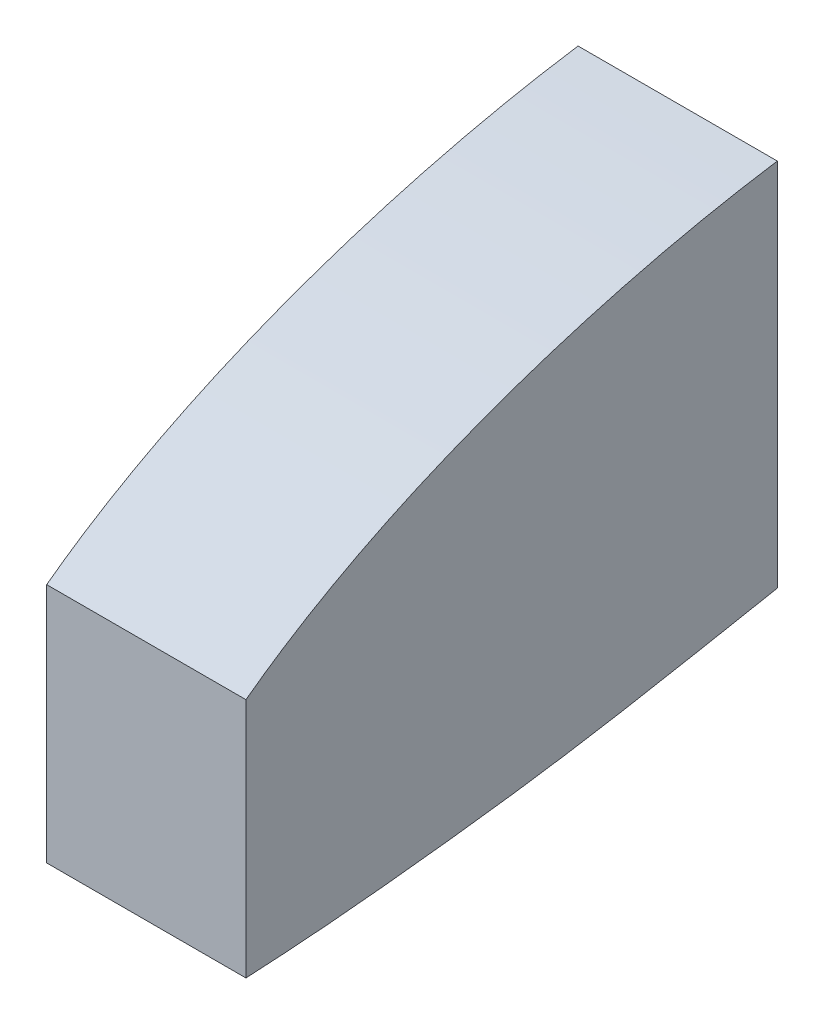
ISO-10303-21;
HEADER;
FILE_DESCRIPTION(('STEP AP214'),'2;1');
FILE_NAME('part.step','',(''),(''),'','','');
FILE_SCHEMA(('AUTOMOTIVE_DESIGN { 1 0 10303 214 1 1 1 1 }'));
ENDSEC;
DATA;
#1=APPLICATION_CONTEXT('core data for automotive mechanical design processes');
#2=APPLICATION_PROTOCOL_DEFINITION('international standard','automotive_design',2000,#1);
#3=PRODUCT_CONTEXT('',#1,'mechanical');
#4=PRODUCT('Part','Part','',(#3));
#5=PRODUCT_RELATED_PRODUCT_CATEGORY('part','',(#4));
#6=PRODUCT_DEFINITION_FORMATION('','',#4);
#7=PRODUCT_DEFINITION_CONTEXT('part definition',#1,'design');
#8=PRODUCT_DEFINITION('design','',#6,#7);
#9=PRODUCT_DEFINITION_SHAPE('','',#8);
#10=(LENGTH_UNIT() NAMED_UNIT(*) SI_UNIT(.MILLI.,.METRE.));
#11=(NAMED_UNIT(*) PLANE_ANGLE_UNIT() SI_UNIT($,.RADIAN.));
#12=(NAMED_UNIT(*) SI_UNIT($,.STERADIAN.) SOLID_ANGLE_UNIT());
#13=UNCERTAINTY_MEASURE_WITH_UNIT(LENGTH_MEASURE(1.E-05),#10,'distance_accuracy_value','');
#14=(GEOMETRIC_REPRESENTATION_CONTEXT(3) GLOBAL_UNCERTAINTY_ASSIGNED_CONTEXT((#13)) GLOBAL_UNIT_ASSIGNED_CONTEXT((#10,
#11,#12)) REPRESENTATION_CONTEXT('',''));
#15=CARTESIAN_POINT('',(0.,0.,0.));
#16=DIRECTION('',(0.,0.,1.));
#17=DIRECTION('',(1.,0.,0.));
#18=AXIS2_PLACEMENT_3D('',#15,#16,#17);
#19=CARTESIAN_POINT('',(9.525,18.9086575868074,-31.75));
#20=CARTESIAN_POINT('',(9.525,18.7680576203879,-30.8282390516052));
#21=CARTESIAN_POINT('',(9.525,18.3939895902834,-28.6506280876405));
#22=CARTESIAN_POINT('',(9.525,17.6485448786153,-25.2979659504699));
#23=CARTESIAN_POINT('',(9.525,16.6729418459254,-21.7621593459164));
#24=CARTESIAN_POINT('',(9.525,15.5707536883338,-18.4462085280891));
#25=CARTESIAN_POINT('',(9.525,14.3677769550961,-15.36422319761));
#26=CARTESIAN_POINT('',(9.525,13.0704558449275,-12.5353548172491));
#27=CARTESIAN_POINT('',(9.525,11.7051463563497,-9.96868307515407));
#28=CARTESIAN_POINT('',(9.525,10.4452751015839,-7.93326586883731));
#29=CARTESIAN_POINT('',(9.525,9.62436987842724,-6.77084144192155));
#30=CARTESIAN_POINT('',(9.525,9.31142365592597,-6.35));
#31=B_SPLINE_CURVE_WITH_KNOTS('',3,(#19,#20,#21,#22,#23,#24,#25,#26,#27,#28,#29,#30),
.UNSPECIFIED.,.F.,.F.,(4,1,1,1,1,1,1,1,1,4),(1.38351151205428,1.39265296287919,1.4051703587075,
1.41717191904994,1.42860351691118,1.43941895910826,1.44959658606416,1.45910207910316,
1.46790787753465,1.47304908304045),.UNSPECIFIED.);
#32=DIRECTION('',(-1.,0.,0.));
#33=VECTOR('',#32,1.);
#34=SURFACE_OF_LINEAR_EXTRUSION('',#31,#33);
#35=CARTESIAN_POINT('',(0.,18.9086575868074,-31.75));
#36=CARTESIAN_POINT('',(0.,18.7680576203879,-30.8282390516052));
#37=CARTESIAN_POINT('',(0.,18.3939895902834,-28.6506280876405));
#38=CARTESIAN_POINT('',(0.,17.6485448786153,-25.2979659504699));
#39=CARTESIAN_POINT('',(0.,16.6729418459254,-21.7621593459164));
#40=CARTESIAN_POINT('',(0.,15.5707536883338,-18.4462085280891));
#41=CARTESIAN_POINT('',(0.,14.3677769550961,-15.36422319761));
#42=CARTESIAN_POINT('',(0.,13.0704558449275,-12.5353548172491));
#43=CARTESIAN_POINT('',(0.,11.7051463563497,-9.96868307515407));
#44=CARTESIAN_POINT('',(0.,10.4452751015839,-7.93326586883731));
#45=CARTESIAN_POINT('',(0.,9.62436987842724,-6.77084144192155));
#46=CARTESIAN_POINT('',(0.,9.31142365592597,-6.35));
#47=B_SPLINE_CURVE_WITH_KNOTS('',3,(#35,#36,#37,#38,#39,#40,#41,#42,#43,#44,#45,#46),
.UNSPECIFIED.,.F.,.F.,(4,1,1,1,1,1,1,1,1,4),(1.38351151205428,1.39265296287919,1.4051703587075,
1.41717191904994,1.42860351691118,1.43941895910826,1.44959658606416,1.45910207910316,
1.46790787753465,1.47304908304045),.UNSPECIFIED.);
#48=CARTESIAN_POINT('',(0.,18.9086575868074,-31.75));
#49=VERTEX_POINT('',#48);
#50=CARTESIAN_POINT('',(0.,9.31142365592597,-6.35));
#51=VERTEX_POINT('',#50);
#52=EDGE_CURVE('E118',#49,#51,#47,.T.);
#53=ORIENTED_EDGE('',*,*,#52,.T.);
#54=DIRECTION('',(-1.,0.,0.));
#55=VECTOR('',#54,1.);
#56=CARTESIAN_POINT('',(9.525,9.31142365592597,-6.35));
#57=LINE('',#56,#55);
#58=CARTESIAN_POINT('',(9.525,9.31142365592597,-6.35));
#59=VERTEX_POINT('',#58);
#60=EDGE_CURVE('E11',#59,#51,#57,.T.);
#61=ORIENTED_EDGE('',*,*,#60,.F.);
#62=CARTESIAN_POINT('',(9.525,18.9086575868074,-31.75));
#63=VERTEX_POINT('',#62);
#64=EDGE_CURVE('E87',#63,#59,#31,.T.);
#65=ORIENTED_EDGE('',*,*,#64,.F.);
#66=DIRECTION('',(-1.,0.,0.));
#67=VECTOR('',#66,1.);
#68=CARTESIAN_POINT('',(9.525,18.9086575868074,-31.75));
#69=LINE('',#68,#67);
#70=EDGE_CURVE('E95',#63,#49,#69,.T.);
#71=ORIENTED_EDGE('',*,*,#70,.T.);
#72=EDGE_LOOP('',(#53,#61,#65,#71));
#73=FACE_BOUND('',#72,.T.);
#74=ADVANCED_FACE('F35',(#73),#34,.F.);
#75=CARTESIAN_POINT('',(9.525,9.31142365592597,-6.35));
#76=DIRECTION('',(0.,0.,-1.));
#77=DIRECTION('',(0.,1.,0.));
#78=AXIS2_PLACEMENT_3D('',#75,#76,#77);
#79=PLANE('',#78);
#80=DIRECTION('',(0.,-1.,0.));
#81=VECTOR('',#80,1.);
#82=CARTESIAN_POINT('',(0.,9.31142365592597,-6.35));
#83=LINE('',#82,#81);
#84=CARTESIAN_POINT('',(0.,-2.21046306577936,-6.34999999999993));
#85=VERTEX_POINT('',#84);
#86=EDGE_CURVE('E91',#51,#85,#83,.T.);
#87=ORIENTED_EDGE('',*,*,#86,.T.);
#88=DIRECTION('',(-1.,0.,0.));
#89=VECTOR('',#88,1.);
#90=CARTESIAN_POINT('',(9.525,-2.21046306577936,-6.34999999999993));
#91=LINE('',#90,#89);
#92=CARTESIAN_POINT('',(9.525,-2.21046306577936,-6.34999999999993));
#93=VERTEX_POINT('',#92);
#94=EDGE_CURVE('E44',#93,#85,#91,.T.);
#95=ORIENTED_EDGE('',*,*,#94,.F.);
#96=DIRECTION('',(0.,-1.,0.));
#97=VECTOR('',#96,1.);
#98=CARTESIAN_POINT('',(9.525,9.31142365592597,-6.35));
#99=LINE('',#98,#97);
#100=EDGE_CURVE('E82',#59,#93,#99,.T.);
#101=ORIENTED_EDGE('',*,*,#100,.F.);
#102=ORIENTED_EDGE('',*,*,#60,.T.);
#103=EDGE_LOOP('',(#87,#95,#101,#102));
#104=FACE_BOUND('',#103,.T.);
#105=ADVANCED_FACE('F90',(#104),#79,.F.);
#106=CARTESIAN_POINT('',(9.525,-2.21046306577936,-6.35));
#107=CARTESIAN_POINT('',(9.525,-2.20381132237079,-6.4865666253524));
#108=CARTESIAN_POINT('',(9.525,-2.14820496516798,-7.56554839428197));
#109=CARTESIAN_POINT('',(9.525,-2.00528239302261,-9.72937621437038));
#110=CARTESIAN_POINT('',(9.525,-1.70699153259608,-12.9698175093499));
#111=CARTESIAN_POINT('',(9.525,-1.3031322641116,-16.6022606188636));
#112=CARTESIAN_POINT('',(9.525,-0.785005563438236,-20.6089964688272));
#113=CARTESIAN_POINT('',(9.525,-0.0604260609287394,-24.9880988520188));
#114=CARTESIAN_POINT('',(9.525,0.653519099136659,-28.7373127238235));
#115=CARTESIAN_POINT('',(9.525,1.09214790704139,-31.0394912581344));
#116=CARTESIAN_POINT('',(9.525,1.2273317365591,-31.75));
#117=B_SPLINE_CURVE_WITH_KNOTS('',3,(#106,#107,#108,#109,#110,#111,#112,#113,#114,#115,#116),
.UNSPECIFIED.,.F.,.F.,(4,1,1,1,1,1,1,1,4),(0.536375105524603,0.537715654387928,
0.546967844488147,0.557637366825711,0.569620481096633,0.582804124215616,0.597246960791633,
0.613135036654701,0.620226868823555),.UNSPECIFIED.);
#118=DIRECTION('',(-1.,0.,0.));
#119=VECTOR('',#118,1.);
#120=SURFACE_OF_LINEAR_EXTRUSION('',#117,#119);
#121=CARTESIAN_POINT('',(0.,-2.21046306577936,-6.35));
#122=CARTESIAN_POINT('',(0.,-2.20381132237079,-6.4865666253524));
#123=CARTESIAN_POINT('',(0.,-2.14820496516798,-7.56554839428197));
#124=CARTESIAN_POINT('',(0.,-2.00528239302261,-9.72937621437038));
#125=CARTESIAN_POINT('',(0.,-1.70699153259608,-12.9698175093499));
#126=CARTESIAN_POINT('',(0.,-1.3031322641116,-16.6022606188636));
#127=CARTESIAN_POINT('',(0.,-0.785005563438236,-20.6089964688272));
#128=CARTESIAN_POINT('',(0.,-0.0604260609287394,-24.9880988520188));
#129=CARTESIAN_POINT('',(0.,0.653519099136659,-28.7373127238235));
#130=CARTESIAN_POINT('',(0.,1.09214790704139,-31.0394912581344));
#131=CARTESIAN_POINT('',(0.,1.2273317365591,-31.75));
#132=B_SPLINE_CURVE_WITH_KNOTS('',3,(#121,#122,#123,#124,#125,#126,#127,#128,#129,#130,#131),
.UNSPECIFIED.,.F.,.F.,(4,1,1,1,1,1,1,1,4),(0.536375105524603,0.537715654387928,
0.546967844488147,0.557637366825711,0.569620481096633,0.582804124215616,0.597246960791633,
0.613135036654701,0.620226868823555),.UNSPECIFIED.);
#133=CARTESIAN_POINT('',(0.,1.2273317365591,-31.75));
#134=VERTEX_POINT('',#133);
#135=EDGE_CURVE('E69',#85,#134,#132,.T.);
#136=ORIENTED_EDGE('',*,*,#135,.T.);
#137=DIRECTION('',(-1.,0.,0.));
#138=VECTOR('',#137,1.);
#139=CARTESIAN_POINT('',(9.525,1.2273317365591,-31.75));
#140=LINE('',#139,#138);
#141=CARTESIAN_POINT('',(9.525,1.2273317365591,-31.75));
#142=VERTEX_POINT('',#141);
#143=EDGE_CURVE('E92',#142,#134,#140,.T.);
#144=ORIENTED_EDGE('',*,*,#143,.F.);
#145=EDGE_CURVE('E85',#93,#142,#117,.T.);
#146=ORIENTED_EDGE('',*,*,#145,.F.);
#147=ORIENTED_EDGE('',*,*,#94,.T.);
#148=EDGE_LOOP('',(#136,#144,#146,#147));
#149=FACE_BOUND('',#148,.T.);
#150=ADVANCED_FACE('F93',(#149),#120,.F.);
#151=CARTESIAN_POINT('',(9.525,18.9086575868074,-31.75));
#152=DIRECTION('',(0.,0.,1.));
#153=DIRECTION('',(0.,-1.,0.));
#154=AXIS2_PLACEMENT_3D('',#151,#152,#153);
#155=PLANE('',#154);
#156=DIRECTION('',(0.,1.,0.));
#157=VECTOR('',#156,1.);
#158=CARTESIAN_POINT('',(0.,18.9086575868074,-31.75));
#159=LINE('',#158,#157);
#160=EDGE_CURVE('E75',#134,#49,#159,.T.);
#161=ORIENTED_EDGE('',*,*,#160,.T.);
#162=ORIENTED_EDGE('',*,*,#70,.F.);
#163=DIRECTION('',(0.,1.,0.));
#164=VECTOR('',#163,1.);
#165=CARTESIAN_POINT('',(9.525,18.9086575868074,-31.75));
#166=LINE('',#165,#164);
#167=EDGE_CURVE('E52',#142,#63,#166,.T.);
#168=ORIENTED_EDGE('',*,*,#167,.F.);
#169=ORIENTED_EDGE('',*,*,#143,.T.);
#170=EDGE_LOOP('',(#161,#162,#168,#169));
#171=FACE_BOUND('',#170,.T.);
#172=ADVANCED_FACE('F107',(#171),#155,.F.);
#173=CARTESIAN_POINT('',(9.525,15.5556187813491,-18.4899715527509));
#174=DIRECTION('',(-1.,0.,0.));
#175=DIRECTION('',(0.,0.,1.));
#176=AXIS2_PLACEMENT_3D('',#173,#174,#175);
#177=PLANE('',#176);
#178=ORIENTED_EDGE('',*,*,#64,.T.);
#179=ORIENTED_EDGE('',*,*,#100,.T.);
#180=ORIENTED_EDGE('',*,*,#145,.T.);
#181=ORIENTED_EDGE('',*,*,#167,.T.);
#182=EDGE_LOOP('',(#178,#179,#180,#181));
#183=FACE_BOUND('',#182,.T.);
#184=ADVANCED_FACE('F83',(#183),#177,.F.);
#185=CARTESIAN_POINT('',(0.,15.5556187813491,-18.4899715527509));
#186=DIRECTION('',(-1.,0.,0.));
#187=DIRECTION('',(0.,0.,1.));
#188=AXIS2_PLACEMENT_3D('',#185,#186,#187);
#189=PLANE('',#188);
#190=ORIENTED_EDGE('',*,*,#52,.F.);
#191=ORIENTED_EDGE('',*,*,#160,.F.);
#192=ORIENTED_EDGE('',*,*,#135,.F.);
#193=ORIENTED_EDGE('',*,*,#86,.F.);
#194=EDGE_LOOP('',(#190,#191,#192,#193));
#195=FACE_BOUND('',#194,.T.);
#196=ADVANCED_FACE('F135',(#195),#189,.T.);
#197=CLOSED_SHELL('',(#74,#105,#150,#172,#184,#196));
#198=MANIFOLD_SOLID_BREP('B2',#197);
#199=ADVANCED_BREP_SHAPE_REPRESENTATION('',(#18,#198),#14);
#200=SHAPE_DEFINITION_REPRESENTATION(#9,#199);
ENDSEC;
END-ISO-10303-21;
